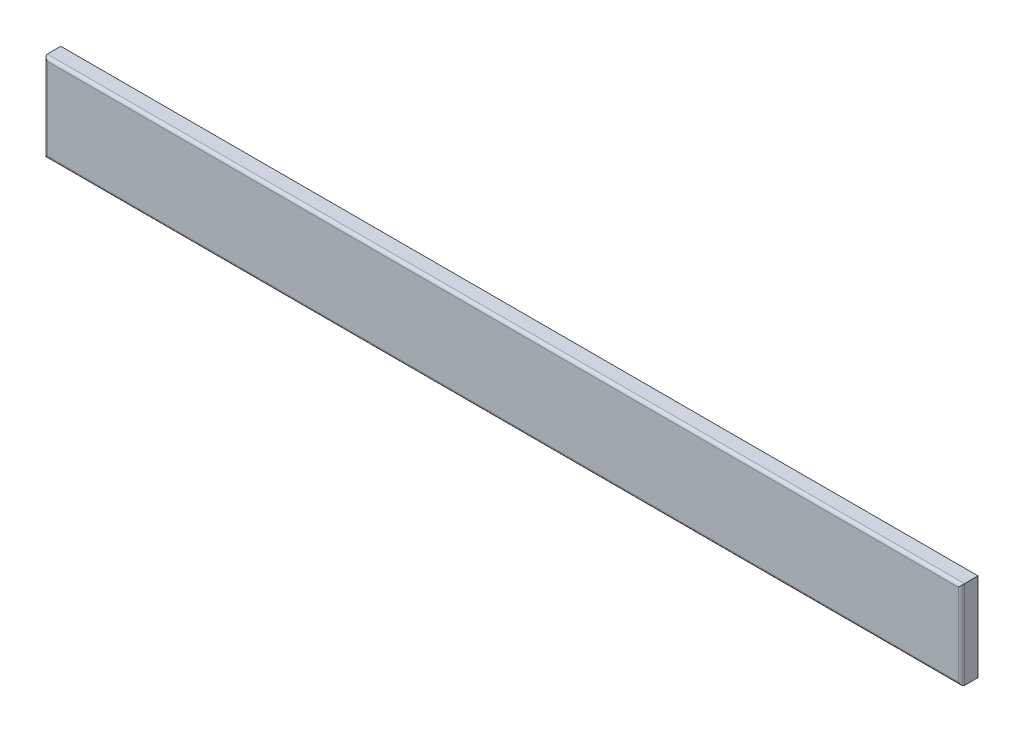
ISO-10303-21;
HEADER;
FILE_DESCRIPTION(('STEP AP214'),'2;1');
FILE_NAME('part.step','',(''),(''),'','','');
FILE_SCHEMA(('AUTOMOTIVE_DESIGN { 1 0 10303 214 1 1 1 1 }'));
ENDSEC;
DATA;
#1=APPLICATION_CONTEXT('core data for automotive mechanical design processes');
#2=APPLICATION_PROTOCOL_DEFINITION('international standard','automotive_design',2000,#1);
#3=PRODUCT_CONTEXT('',#1,'mechanical');
#4=PRODUCT('Part','Part','',(#3));
#5=PRODUCT_RELATED_PRODUCT_CATEGORY('part','',(#4));
#6=PRODUCT_DEFINITION_FORMATION('','',#4);
#7=PRODUCT_DEFINITION_CONTEXT('part definition',#1,'design');
#8=PRODUCT_DEFINITION('design','',#6,#7);
#9=PRODUCT_DEFINITION_SHAPE('','',#8);
#10=(LENGTH_UNIT() NAMED_UNIT(*) SI_UNIT(.MILLI.,.METRE.));
#11=(NAMED_UNIT(*) PLANE_ANGLE_UNIT() SI_UNIT($,.RADIAN.));
#12=(NAMED_UNIT(*) SI_UNIT($,.STERADIAN.) SOLID_ANGLE_UNIT());
#13=UNCERTAINTY_MEASURE_WITH_UNIT(LENGTH_MEASURE(1.E-05),#10,'distance_accuracy_value','');
#14=(GEOMETRIC_REPRESENTATION_CONTEXT(3) GLOBAL_UNCERTAINTY_ASSIGNED_CONTEXT((#13)) GLOBAL_UNIT_ASSIGNED_CONTEXT((#10,
#11,#12)) REPRESENTATION_CONTEXT('',''));
#15=CARTESIAN_POINT('',(0.,0.,0.));
#16=DIRECTION('',(0.,0.,1.));
#17=DIRECTION('',(1.,0.,0.));
#18=AXIS2_PLACEMENT_3D('',#15,#16,#17);
#19=CARTESIAN_POINT('',(-442.1,1089.8,16.));
#20=DIRECTION('',(1.,0.,0.));
#21=DIRECTION('',(0.,0.,-1.));
#22=AXIS2_PLACEMENT_3D('',#19,#20,#21);
#23=PLANE('',#22);
#24=DIRECTION('',(0.,0.,-1.));
#25=VECTOR('',#24,1.);
#26=CARTESIAN_POINT('',(-442.1,1004.8,16.));
#27=LINE('',#26,#25);
#28=CARTESIAN_POINT('',(-442.1,1004.8,13.));
#29=VERTEX_POINT('',#28);
#30=CARTESIAN_POINT('',(-442.1,1004.8,0.));
#31=VERTEX_POINT('',#30);
#32=EDGE_CURVE('E90',#29,#31,#27,.T.);
#33=ORIENTED_EDGE('',*,*,#32,.F.);
#34=DIRECTION('',(0.,-1.,0.));
#35=VECTOR('',#34,1.);
#36=CARTESIAN_POINT('',(-442.1,1089.8,13.));
#37=LINE('',#36,#35);
#38=CARTESIAN_POINT('',(-442.1,1089.8,13.));
#39=VERTEX_POINT('',#38);
#40=EDGE_CURVE('E11',#29,#39,#37,.F.);
#41=ORIENTED_EDGE('',*,*,#40,.T.);
#42=DIRECTION('',(0.,0.,-1.));
#43=VECTOR('',#42,1.);
#44=CARTESIAN_POINT('',(-442.1,1089.8,16.));
#45=LINE('',#44,#43);
#46=CARTESIAN_POINT('',(-442.1,1089.8,0.));
#47=VERTEX_POINT('',#46);
#48=EDGE_CURVE('E107',#39,#47,#45,.T.);
#49=ORIENTED_EDGE('',*,*,#48,.T.);
#50=DIRECTION('',(0.,-1.,0.));
#51=VECTOR('',#50,1.);
#52=CARTESIAN_POINT('',(-442.1,1089.8,0.));
#53=LINE('',#52,#51);
#54=EDGE_CURVE('E103',#47,#31,#53,.T.);
#55=ORIENTED_EDGE('',*,*,#54,.T.);
#56=EDGE_LOOP('',(#33,#41,#49,#55));
#57=FACE_BOUND('',#56,.T.);
#58=ADVANCED_FACE('F38',(#57),#23,.F.);
#59=CARTESIAN_POINT('',(-442.1,1004.8,16.));
#60=DIRECTION('',(0.,1.,0.));
#61=DIRECTION('',(0.,0.,1.));
#62=AXIS2_PLACEMENT_3D('',#59,#60,#61);
#63=PLANE('',#62);
#64=DIRECTION('',(0.,0.,-1.));
#65=VECTOR('',#64,1.);
#66=CARTESIAN_POINT('',(442.1,1004.8,16.));
#67=LINE('',#66,#65);
#68=CARTESIAN_POINT('',(442.1,1004.8,13.));
#69=VERTEX_POINT('',#68);
#70=CARTESIAN_POINT('',(442.1,1004.8,0.));
#71=VERTEX_POINT('',#70);
#72=EDGE_CURVE('E97',#69,#71,#67,.T.);
#73=ORIENTED_EDGE('',*,*,#72,.F.);
#74=DIRECTION('',(1.,0.,0.));
#75=VECTOR('',#74,1.);
#76=CARTESIAN_POINT('',(-442.1,1004.8,13.));
#77=LINE('',#76,#75);
#78=EDGE_CURVE('E61',#69,#29,#77,.F.);
#79=ORIENTED_EDGE('',*,*,#78,.T.);
#80=ORIENTED_EDGE('',*,*,#32,.T.);
#81=DIRECTION('',(1.,0.,0.));
#82=VECTOR('',#81,1.);
#83=CARTESIAN_POINT('',(-442.1,1004.8,0.));
#84=LINE('',#83,#82);
#85=EDGE_CURVE('E93',#31,#71,#84,.T.);
#86=ORIENTED_EDGE('',*,*,#85,.T.);
#87=EDGE_LOOP('',(#73,#79,#80,#86));
#88=FACE_BOUND('',#87,.T.);
#89=ADVANCED_FACE('F92',(#88),#63,.F.);
#90=CARTESIAN_POINT('',(442.1,1089.8,16.));
#91=DIRECTION('',(-1.,0.,0.));
#92=DIRECTION('',(0.,0.,1.));
#93=AXIS2_PLACEMENT_3D('',#90,#91,#92);
#94=PLANE('',#93);
#95=DIRECTION('',(0.,0.,-1.));
#96=VECTOR('',#95,1.);
#97=CARTESIAN_POINT('',(442.1,1089.8,16.));
#98=LINE('',#97,#96);
#99=CARTESIAN_POINT('',(442.1,1089.8,13.));
#100=VERTEX_POINT('',#99);
#101=CARTESIAN_POINT('',(442.1,1089.8,0.));
#102=VERTEX_POINT('',#101);
#103=EDGE_CURVE('E117',#100,#102,#98,.T.);
#104=ORIENTED_EDGE('',*,*,#103,.F.);
#105=DIRECTION('',(0.,1.,0.));
#106=VECTOR('',#105,1.);
#107=CARTESIAN_POINT('',(442.1,1004.8,13.));
#108=LINE('',#107,#106);
#109=EDGE_CURVE('E128',#100,#69,#108,.F.);
#110=ORIENTED_EDGE('',*,*,#109,.T.);
#111=ORIENTED_EDGE('',*,*,#72,.T.);
#112=DIRECTION('',(0.,1.,0.));
#113=VECTOR('',#112,1.);
#114=CARTESIAN_POINT('',(442.1,1089.8,0.));
#115=LINE('',#114,#113);
#116=EDGE_CURVE('E105',#71,#102,#115,.T.);
#117=ORIENTED_EDGE('',*,*,#116,.T.);
#118=EDGE_LOOP('',(#104,#110,#111,#117));
#119=FACE_BOUND('',#118,.T.);
#120=ADVANCED_FACE('F156',(#119),#94,.F.);
#121=CARTESIAN_POINT('',(-442.1,1089.8,16.));
#122=DIRECTION('',(0.,-1.,0.));
#123=DIRECTION('',(0.,0.,-1.));
#124=AXIS2_PLACEMENT_3D('',#121,#122,#123);
#125=PLANE('',#124);
#126=ORIENTED_EDGE('',*,*,#48,.F.);
#127=DIRECTION('',(-1.,0.,0.));
#128=VECTOR('',#127,1.);
#129=CARTESIAN_POINT('',(442.1,1089.8,13.));
#130=LINE('',#129,#128);
#131=EDGE_CURVE('E47',#39,#100,#130,.F.);
#132=ORIENTED_EDGE('',*,*,#131,.T.);
#133=ORIENTED_EDGE('',*,*,#103,.T.);
#134=DIRECTION('',(-1.,0.,0.));
#135=VECTOR('',#134,1.);
#136=CARTESIAN_POINT('',(-442.1,1089.8,0.));
#137=LINE('',#136,#135);
#138=EDGE_CURVE('E114',#102,#47,#137,.T.);
#139=ORIENTED_EDGE('',*,*,#138,.T.);
#140=EDGE_LOOP('',(#126,#132,#133,#139));
#141=FACE_BOUND('',#140,.T.);
#142=ADVANCED_FACE('F158',(#141),#125,.F.);
#143=CARTESIAN_POINT('',(0.,0.,16.));
#144=DIRECTION('',(0.,0.,1.));
#145=DIRECTION('',(1.,0.,0.));
#146=AXIS2_PLACEMENT_3D('',#143,#144,#145);
#147=PLANE('',#146);
#148=DIRECTION('',(1.,0.,0.));
#149=VECTOR('',#148,1.);
#150=CARTESIAN_POINT('',(442.1,1007.8,16.));
#151=LINE('',#150,#149);
#152=CARTESIAN_POINT('',(-439.1,1007.8,16.));
#153=VERTEX_POINT('',#152);
#154=CARTESIAN_POINT('',(439.1,1007.8,16.));
#155=VERTEX_POINT('',#154);
#156=EDGE_CURVE('E123',#153,#155,#151,.T.);
#157=ORIENTED_EDGE('',*,*,#156,.T.);
#158=DIRECTION('',(0.,1.,0.));
#159=VECTOR('',#158,1.);
#160=CARTESIAN_POINT('',(439.1,1089.8,16.));
#161=LINE('',#160,#159);
#162=CARTESIAN_POINT('',(439.1,1086.8,16.));
#163=VERTEX_POINT('',#162);
#164=EDGE_CURVE('E125',#155,#163,#161,.T.);
#165=ORIENTED_EDGE('',*,*,#164,.T.);
#166=DIRECTION('',(-1.,0.,0.));
#167=VECTOR('',#166,1.);
#168=CARTESIAN_POINT('',(-442.1,1086.8,16.));
#169=LINE('',#168,#167);
#170=CARTESIAN_POINT('',(-439.1,1086.8,16.));
#171=VERTEX_POINT('',#170);
#172=EDGE_CURVE('E121',#163,#171,#169,.T.);
#173=ORIENTED_EDGE('',*,*,#172,.T.);
#174=DIRECTION('',(0.,-1.,0.));
#175=VECTOR('',#174,1.);
#176=CARTESIAN_POINT('',(-439.1,1004.8,16.));
#177=LINE('',#176,#175);
#178=EDGE_CURVE('E96',#171,#153,#177,.T.);
#179=ORIENTED_EDGE('',*,*,#178,.T.);
#180=EDGE_LOOP('',(#157,#165,#173,#179));
#181=FACE_BOUND('',#180,.T.);
#182=ADVANCED_FACE('F148',(#181),#147,.T.);
#183=CARTESIAN_POINT('',(0.,0.,0.));
#184=DIRECTION('',(0.,0.,1.));
#185=DIRECTION('',(1.,0.,0.));
#186=AXIS2_PLACEMENT_3D('',#183,#184,#185);
#187=PLANE('',#186);
#188=ORIENTED_EDGE('',*,*,#54,.F.);
#189=ORIENTED_EDGE('',*,*,#138,.F.);
#190=ORIENTED_EDGE('',*,*,#116,.F.);
#191=ORIENTED_EDGE('',*,*,#85,.F.);
#192=EDGE_LOOP('',(#188,#189,#190,#191));
#193=FACE_BOUND('',#192,.T.);
#194=ADVANCED_FACE('F101',(#193),#187,.F.);
#195=CARTESIAN_POINT('',(-439.1,0.,13.));
#196=DIRECTION('',(0.,1.,0.));
#197=DIRECTION('',(0.,0.,1.));
#198=AXIS2_PLACEMENT_3D('',#195,#196,#197);
#199=CYLINDRICAL_SURFACE('',#198,3.);
#200=CARTESIAN_POINT('',(-439.1,1086.8,13.));
#201=DIRECTION('',(0.707106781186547,0.707106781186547,0.));
#202=DIRECTION('',(-0.707106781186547,0.707106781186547,0.));
#203=AXIS2_PLACEMENT_3D('',#200,#201,#202);
#204=ELLIPSE('',#203,4.24264068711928,3.);
#205=EDGE_CURVE('E111',#39,#171,#204,.T.);
#206=ORIENTED_EDGE('',*,*,#205,.F.);
#207=ORIENTED_EDGE('',*,*,#40,.F.);
#208=CARTESIAN_POINT('',(-439.1,1007.8,13.));
#209=DIRECTION('',(-0.707106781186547,0.707106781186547,0.));
#210=DIRECTION('',(0.707106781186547,0.707106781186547,0.));
#211=AXIS2_PLACEMENT_3D('',#208,#209,#210);
#212=ELLIPSE('',#211,4.24264068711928,3.);
#213=EDGE_CURVE('E42',#153,#29,#212,.F.);
#214=ORIENTED_EDGE('',*,*,#213,.F.);
#215=ORIENTED_EDGE('',*,*,#178,.F.);
#216=EDGE_LOOP('',(#206,#207,#214,#215));
#217=FACE_BOUND('',#216,.T.);
#218=ADVANCED_FACE('F40',(#217),#199,.T.);
#219=CARTESIAN_POINT('',(0.,1007.8,13.));
#220=DIRECTION('',(-1.,0.,0.));
#221=DIRECTION('',(0.,0.,1.));
#222=AXIS2_PLACEMENT_3D('',#219,#220,#221);
#223=CYLINDRICAL_SURFACE('',#222,3.);
#224=ORIENTED_EDGE('',*,*,#213,.T.);
#225=ORIENTED_EDGE('',*,*,#78,.F.);
#226=CARTESIAN_POINT('',(439.1,1007.8,13.));
#227=DIRECTION('',(-0.707106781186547,-0.707106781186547,0.));
#228=DIRECTION('',(-0.707106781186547,0.707106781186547,0.));
#229=AXIS2_PLACEMENT_3D('',#226,#227,#228);
#230=ELLIPSE('',#229,4.24264068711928,3.);
#231=EDGE_CURVE('E135',#155,#69,#230,.F.);
#232=ORIENTED_EDGE('',*,*,#231,.F.);
#233=ORIENTED_EDGE('',*,*,#156,.F.);
#234=EDGE_LOOP('',(#224,#225,#232,#233));
#235=FACE_BOUND('',#234,.T.);
#236=ADVANCED_FACE('F178',(#235),#223,.T.);
#237=CARTESIAN_POINT('',(0.,1086.8,13.));
#238=DIRECTION('',(1.,0.,0.));
#239=DIRECTION('',(0.,0.,-1.));
#240=AXIS2_PLACEMENT_3D('',#237,#238,#239);
#241=CYLINDRICAL_SURFACE('',#240,3.);
#242=ORIENTED_EDGE('',*,*,#205,.T.);
#243=ORIENTED_EDGE('',*,*,#172,.F.);
#244=CARTESIAN_POINT('',(439.1,1086.8,13.));
#245=DIRECTION('',(0.707106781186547,-0.707106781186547,0.));
#246=DIRECTION('',(0.707106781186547,0.707106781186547,0.));
#247=AXIS2_PLACEMENT_3D('',#244,#245,#246);
#248=ELLIPSE('',#247,4.24264068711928,3.);
#249=EDGE_CURVE('E133',#100,#163,#248,.T.);
#250=ORIENTED_EDGE('',*,*,#249,.F.);
#251=ORIENTED_EDGE('',*,*,#131,.F.);
#252=EDGE_LOOP('',(#242,#243,#250,#251));
#253=FACE_BOUND('',#252,.T.);
#254=ADVANCED_FACE('F141',(#253),#241,.T.);
#255=CARTESIAN_POINT('',(439.1,0.,13.));
#256=DIRECTION('',(0.,-1.,0.));
#257=DIRECTION('',(0.,0.,-1.));
#258=AXIS2_PLACEMENT_3D('',#255,#256,#257);
#259=CYLINDRICAL_SURFACE('',#258,3.);
#260=ORIENTED_EDGE('',*,*,#231,.T.);
#261=ORIENTED_EDGE('',*,*,#109,.F.);
#262=ORIENTED_EDGE('',*,*,#249,.T.);
#263=ORIENTED_EDGE('',*,*,#164,.F.);
#264=EDGE_LOOP('',(#260,#261,#262,#263));
#265=FACE_BOUND('',#264,.T.);
#266=ADVANCED_FACE('F152',(#265),#259,.T.);
#267=CLOSED_SHELL('',(#58,#89,#120,#142,#182,#194,#218,#236,#254,#266));
#268=MANIFOLD_SOLID_BREP('B2',#267);
#269=ADVANCED_BREP_SHAPE_REPRESENTATION('',(#18,#268),#14);
#270=SHAPE_DEFINITION_REPRESENTATION(#9,#269);
ENDSEC;
END-ISO-10303-21;
